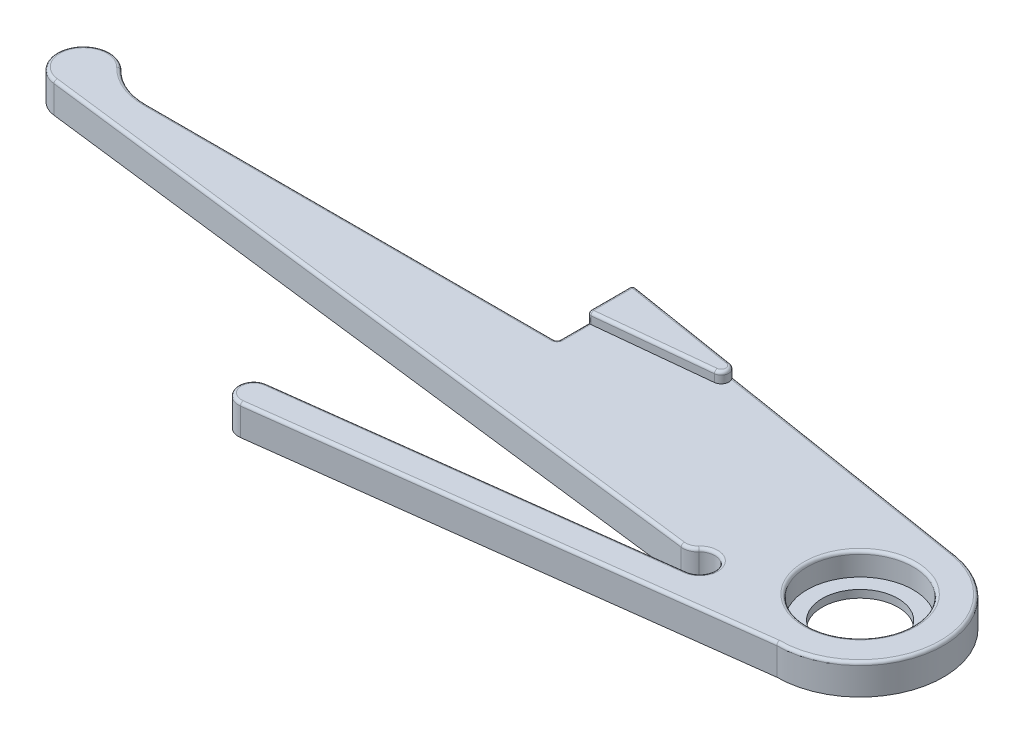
from build123d import *

# Parameters (mm, degrees)
SKETCH_1_R          = 2.5
EXTRUDE_1_DEPTH     = 2
EXTRUDE_2_DEPTH     = 0.7
SKETCH_3_R          = 3.5
CUT_EXTRUDE_1_DEPTH = 1.5
FILLET_1_R          = 4
FILLET_2_R          = 0.5
FILLET_3_R          = 0.2
FILLET_4_R          = 0.2
FILLET_5_R          = 0.2
FILLET_6_R          = 0.2


with BuildPart() as part:
    # Sketch 1 → Extrude 1 (new body)
    with BuildSketch(Plane(origin=(0, 0, 0), x_dir=(1, 0, 0), z_dir=(0, 1, 0))):
        with BuildLine():
            Line((-24.5, 9.499999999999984), (0.8710441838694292, 5.430587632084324))
            ThreePointArc((0.8710441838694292, 5.430587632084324), (5.482619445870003, -0.43690274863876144), (0, -5.5))
            Line((0, -5.5), (-31.38158548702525, -9.5))
            ThreePointArc((-31.38158548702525, -9.5), (-32.5, -8.634466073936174), (-31.634466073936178, -7.516051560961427))
            Line((-31.634466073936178, -7.516051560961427), (-7.06735245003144, -4.384646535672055))
            ThreePointArc((-7.06735245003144, -4.384646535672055), (-6.3045053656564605, -2.935323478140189), (-7.927147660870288, -2.7128263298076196))
            ThreePointArc((-7.927147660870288, -2.7128263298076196), (-8.317101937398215, -2.9721693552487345), (-8.782371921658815, -3.025526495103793))
            Line((-8.782371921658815, -3.025526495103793), (-55.963271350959, 2.7675595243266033))
            ThreePointArc((-55.963271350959, 2.7675595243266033), (-56.90789324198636, 5.816682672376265), (-54.000005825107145, 4.499999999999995))
            Line((-54.000005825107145, 4.499999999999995), (-24.500000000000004, 4.499999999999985))
            Line((-24.500000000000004, 4.499999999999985), (-24.5, 9.499999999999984))
        make_face()
        with Locations(Location((0, 0, 0), (0, 0, 270))):
            Circle(SKETCH_1_R, mode=Mode.SUBTRACT)
    extrude(amount=EXTRUDE_1_DEPTH)

    # Sketch 2 → Extrude 2 (add)
    with BuildSketch(Plane(origin=(0, 2, 0), x_dir=(1, 0, 0), z_dir=(0, 1, 0))):
        Polygon((-24.5, 9.499999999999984), (-24.499999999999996, 6.499999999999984), (-13.115545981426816, 7.673979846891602), align=None)
    extrude(amount=EXTRUDE_2_DEPTH)

    # Sketch 3 → Cut-Extrude 1 (cut)
    with BuildSketch(Plane(origin=(0, 2, 0), x_dir=(1, 0, 0), z_dir=(0, 1, 0))):
        with Locations(Location((0, 0, 0), (0, 0, 270))):
            Circle(SKETCH_3_R)
    extrude(amount=-CUT_EXTRUDE_1_DEPTH, mode=Mode.SUBTRACT)

    # Fillet 1
    fillet_1_edges = [part.edges().sort_by_distance(p)[0] for p in [
        (-54.000005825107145, 1, -4.499999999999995),
    ]]
    fillet(fillet_1_edges, radius=FILLET_1_R)

    # Fillet 2
    fillet_2_edges = [part.edges().sort_by_distance(p)[0] for p in [
        (-13.115545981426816, 2.35, -7.673979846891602),
    ]]
    fillet(fillet_2_edges, radius=FILLET_2_R)

    # Fillet 3
    fillet_3_edges = [part.edges().sort_by_distance(p)[0] for p in [
        (1.07e-15, 2, -3.5),
    ]]
    fillet(fillet_3_edges, radius=FILLET_3_R)

    # Fillet 4
    fillet_4_edges = [part.edges().sort_by_distance(p)[0] for p in [
        (-24.5, 1.35, -9.499999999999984),
        (-24.499999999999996, 2.35, -6.499999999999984),
    ]]
    fillet(fillet_4_edges, radius=FILLET_4_R)

    # Fillet 5
    fillet_5_edges = [part.edges().sort_by_distance(p)[0] for p in [
        (-24.500000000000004, 1, -4.499999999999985),
    ]]
    fillet(fillet_5_edges, radius=FILLET_5_R)

    # Fillet 6
    fillet_6_edges = [part.edges().sort_by_distance(p)[0] for p in [
        (-8.317101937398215, 2, 2.9721693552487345),
        (-6.3045053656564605, 2, 2.935323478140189),
        (-19.35090926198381, 2, 5.950349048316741),
        (-32.5, 2, 8.634466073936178),
        (-15.690792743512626, 2, 7.5),
        (5.482619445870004, 2, 0.436902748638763),
        (-24.500000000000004, 2, -5.7108424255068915),
        (-7.9972240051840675, 2, -6.85302180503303),
        (-57.31624831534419, 2, -5.285134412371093),
        (-53.177345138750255, 2, -4.817754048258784),
        (-20.56690893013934, 2.7, -8.869148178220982),
        (-16.44487600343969, 2.7, -7.767697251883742),
        (-20.586436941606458, 2.7, -6.903571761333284),
        (-24.499999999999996, 2.7, -7.993524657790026),
        (-24.429740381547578, 2.7, -9.417572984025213),
        (-24.433971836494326, 2.7, -6.573187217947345),
        (-32.372821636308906, 2, 0.12898348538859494),
        (-38.15747721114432, 2, -4.499999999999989),
        (-24.558578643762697, 2, -4.558578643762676),
    ]]
    fillet(fillet_6_edges, radius=FILLET_6_R)


solid = part.part
